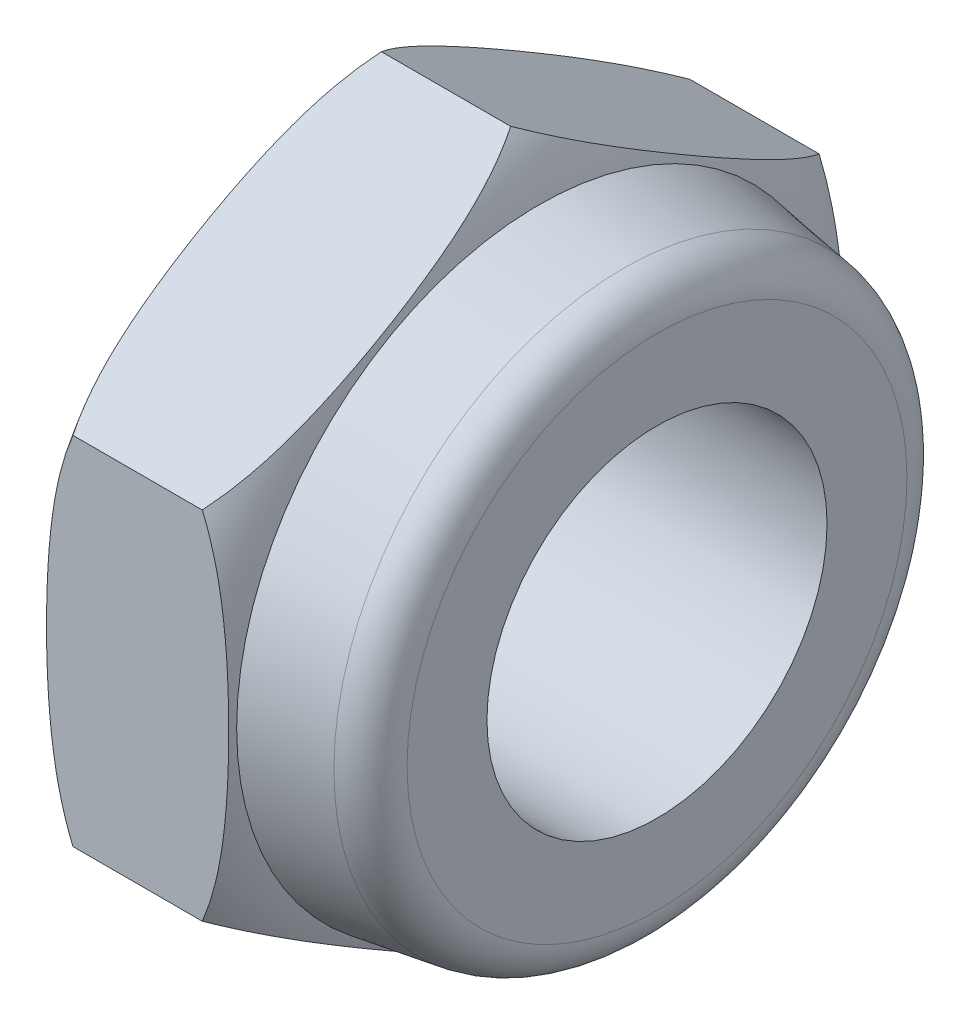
from build123d import *

# Parameters (mm, degrees)
SKETCH1_R          = 2.54
PLACE_HOLDER_DEPTH = 0.254
SKETCH5_R          = 8.900196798
CUT_EXTRUDE2_DEPTH = 13.159324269


with BuildPart() as part:
    # Sketch1 → Place Holder (new body)
    with BuildSketch(Plane(origin=(0, 0, 0), x_dir=(0, 0, -1), z_dir=(1, 0, 0))):
        Circle(SKETCH1_R)
    extrude(amount=PLACE_HOLDER_DEPTH)


with BuildPart() as body_2:
    # Sketch4 → Revolve2 (revolve)
    with BuildSketch(Plane.XY, mode=Mode.PRIVATE) as revolve2_sk:
        with BuildLine():
            Line((0, 3.50139), (6.35, 3.50139))
            Line((6.35, 3.50139), (6.35, 5.146240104))
            ThreePointArc((6.35, 5.146240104), (6.152201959, 5.680507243), (5.654180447, 5.957165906))
            Line((5.654180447, 5.957165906), (3.918731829, 6.223878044))
            ThreePointArc((3.918731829, 6.223878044), (3.69054617, 6.810648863), (3.338128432, 7.332348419))
            Line((3.338128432, 7.332348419), (0.675071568, 7.332348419))
            ThreePointArc((0.675071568, 7.332348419), (0.174132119, 6.475981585), (0, 5.499261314))
            Line((0, 5.499261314), (0, 3.50139))
        make_face()
    revolve(revolve2_sk.sketch.rotate(Axis((0, 0, 0), (1, 0, 0)), 90), axis=Axis((0, 0, 0), (1, 0, 0)))

    # Sketch5 → Cut-Extrude2 (cut, through all)
    with BuildSketch(Plane.ZY):
        Circle(SKETCH5_R)
        Polygon((0, 7.332348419), (-6.35, 3.666174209), (-6.35, -3.666174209), (0, -7.332348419), (6.35, -3.666174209), (6.35, 3.666174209), align=None, mode=Mode.SUBTRACT)
    extrude(amount=-CUT_EXTRUDE2_DEPTH, mode=Mode.SUBTRACT)


solid = Compound([part.part, body_2.part])
